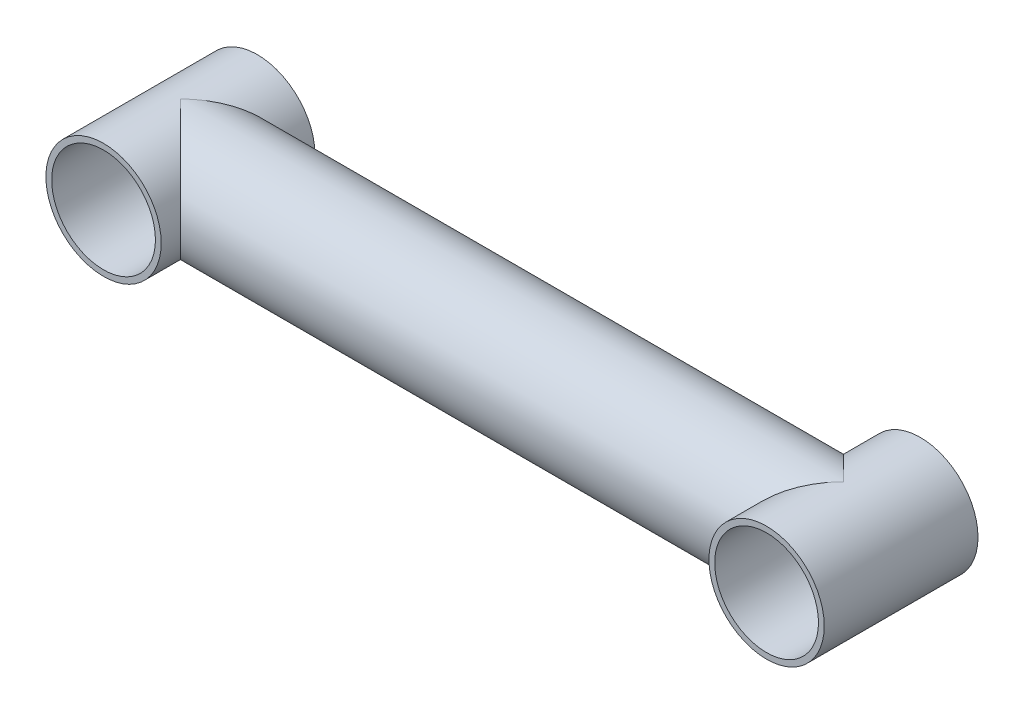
ISO-10303-21;
HEADER;
FILE_DESCRIPTION(('STEP AP214'),'2;1');
FILE_NAME('part.step','',(''),(''),'','','');
FILE_SCHEMA(('AUTOMOTIVE_DESIGN { 1 0 10303 214 1 1 1 1 }'));
ENDSEC;
DATA;
#1=APPLICATION_CONTEXT('core data for automotive mechanical design processes');
#2=APPLICATION_PROTOCOL_DEFINITION('international standard','automotive_design',2000,#1);
#3=PRODUCT_CONTEXT('',#1,'mechanical');
#4=PRODUCT('Part','Part','',(#3));
#5=PRODUCT_RELATED_PRODUCT_CATEGORY('part','',(#4));
#6=PRODUCT_DEFINITION_FORMATION('','',#4);
#7=PRODUCT_DEFINITION_CONTEXT('part definition',#1,'design');
#8=PRODUCT_DEFINITION('design','',#6,#7);
#9=PRODUCT_DEFINITION_SHAPE('','',#8);
#10=(LENGTH_UNIT() NAMED_UNIT(*) SI_UNIT(.MILLI.,.METRE.));
#11=(NAMED_UNIT(*) PLANE_ANGLE_UNIT() SI_UNIT($,.RADIAN.));
#12=(NAMED_UNIT(*) SI_UNIT($,.STERADIAN.) SOLID_ANGLE_UNIT());
#13=UNCERTAINTY_MEASURE_WITH_UNIT(LENGTH_MEASURE(1.E-05),#10,'distance_accuracy_value','');
#14=(GEOMETRIC_REPRESENTATION_CONTEXT(3) GLOBAL_UNCERTAINTY_ASSIGNED_CONTEXT((#13)) GLOBAL_UNIT_ASSIGNED_CONTEXT((#10,
#11,#12)) REPRESENTATION_CONTEXT('',''));
#15=CARTESIAN_POINT('',(0.,0.,0.));
#16=DIRECTION('',(0.,0.,1.));
#17=DIRECTION('',(1.,0.,0.));
#18=AXIS2_PLACEMENT_3D('',#15,#16,#17);
#19=CARTESIAN_POINT('',(-345.,1.38777878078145E-13,0.));
#20=DIRECTION('',(1.,0.,0.));
#21=DIRECTION('',(0.,0.,-1.));
#22=AXIS2_PLACEMENT_3D('',#19,#20,#21);
#23=CYLINDRICAL_SURFACE('',#22,30.);
#24=CARTESIAN_POINT('',(0.,0.,0.));
#25=DIRECTION('',(0.707106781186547,0.,0.707106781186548));
#26=DIRECTION('',(0.707106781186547,0.,-0.707106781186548));
#27=AXIS2_PLACEMENT_3D('',#24,#25,#26);
#28=ELLIPSE('',#27,42.4264068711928,30.);
#29=CARTESIAN_POINT('',(0.,-30.,0.));
#30=VERTEX_POINT('',#29);
#31=CARTESIAN_POINT('',(0.,30.0000000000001,0.));
#32=VERTEX_POINT('',#31);
#33=EDGE_CURVE('E88',#30,#32,#28,.F.);
#34=ORIENTED_EDGE('',*,*,#33,.T.);
#35=CARTESIAN_POINT('',(0.,0.,0.));
#36=DIRECTION('',(0.707106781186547,0.,-0.707106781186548));
#37=DIRECTION('',(0.707106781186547,0.,0.707106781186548));
#38=AXIS2_PLACEMENT_3D('',#35,#36,#37);
#39=ELLIPSE('',#38,42.4264068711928,30.);
#40=EDGE_CURVE('E70',#32,#30,#39,.F.);
#41=ORIENTED_EDGE('',*,*,#40,.T.);
#42=EDGE_LOOP('',(#34,#41));
#43=FACE_BOUND('',#42,.T.);
#44=CARTESIAN_POINT('',(-345.,1.38777878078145E-13,0.));
#45=DIRECTION('',(0.707106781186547,0.,0.707106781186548));
#46=DIRECTION('',(0.707106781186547,0.,-0.707106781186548));
#47=AXIS2_PLACEMENT_3D('',#44,#45,#46);
#48=ELLIPSE('',#47,42.4264068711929,30.);
#49=CARTESIAN_POINT('',(-345.,-29.9999999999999,0.));
#50=VERTEX_POINT('',#49);
#51=CARTESIAN_POINT('',(-345.,30.0000000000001,0.));
#52=VERTEX_POINT('',#51);
#53=EDGE_CURVE('E75',#50,#52,#48,.T.);
#54=ORIENTED_EDGE('',*,*,#53,.T.);
#55=CARTESIAN_POINT('',(-345.,1.38777878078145E-13,0.));
#56=DIRECTION('',(0.707106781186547,0.,-0.707106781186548));
#57=DIRECTION('',(0.707106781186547,0.,0.707106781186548));
#58=AXIS2_PLACEMENT_3D('',#55,#56,#57);
#59=ELLIPSE('',#58,42.4264068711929,30.);
#60=EDGE_CURVE('E63',#52,#50,#59,.T.);
#61=ORIENTED_EDGE('',*,*,#60,.T.);
#62=EDGE_LOOP('',(#54,#61));
#63=FACE_BOUND('',#62,.T.);
#64=ADVANCED_FACE('F45',(#43,#63),#23,.T.);
#65=CARTESIAN_POINT('',(0.,0.,40.));
#66=DIRECTION('',(0.,0.,-1.));
#67=DIRECTION('',(-1.,0.,0.));
#68=AXIS2_PLACEMENT_3D('',#65,#66,#67);
#69=CYLINDRICAL_SURFACE('',#68,30.);
#70=ORIENTED_EDGE('',*,*,#40,.F.);
#71=ORIENTED_EDGE('',*,*,#33,.F.);
#72=EDGE_LOOP('',(#70,#71));
#73=FACE_BOUND('',#72,.T.);
#74=CARTESIAN_POINT('',(0.,0.,40.));
#75=DIRECTION('',(0.,0.,1.));
#76=DIRECTION('',(1.,0.,0.));
#77=AXIS2_PLACEMENT_3D('',#74,#75,#76);
#78=CIRCLE('',#77,30.);
#79=CARTESIAN_POINT('',(30.,0.,40.));
#80=VERTEX_POINT('',#79);
#81=EDGE_CURVE('E84',#80,#80,#78,.T.);
#82=ORIENTED_EDGE('',*,*,#81,.F.);
#83=EDGE_LOOP('',(#82));
#84=FACE_BOUND('',#83,.T.);
#85=CARTESIAN_POINT('',(0.,0.,-40.));
#86=DIRECTION('',(0.,0.,1.));
#87=DIRECTION('',(1.,0.,0.));
#88=AXIS2_PLACEMENT_3D('',#85,#86,#87);
#89=CIRCLE('',#88,30.);
#90=CARTESIAN_POINT('',(30.,0.,-40.));
#91=VERTEX_POINT('',#90);
#92=EDGE_CURVE('E81',#91,#91,#89,.T.);
#93=ORIENTED_EDGE('',*,*,#92,.T.);
#94=EDGE_LOOP('',(#93));
#95=FACE_BOUND('',#94,.T.);
#96=ADVANCED_FACE('F109',(#73,#84,#95),#69,.T.);
#97=CARTESIAN_POINT('',(0.,0.,40.));
#98=DIRECTION('',(0.,0.,1.));
#99=DIRECTION('',(1.,0.,0.));
#100=AXIS2_PLACEMENT_3D('',#97,#98,#99);
#101=PLANE('',#100);
#102=CARTESIAN_POINT('',(0.,0.,40.));
#103=DIRECTION('',(0.,0.,1.));
#104=DIRECTION('',(1.,0.,0.));
#105=AXIS2_PLACEMENT_3D('',#102,#103,#104);
#106=CIRCLE('',#105,27.0000000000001);
#107=CARTESIAN_POINT('',(27.,0.,40.));
#108=VERTEX_POINT('',#107);
#109=EDGE_CURVE('E159',#108,#108,#106,.T.);
#110=ORIENTED_EDGE('',*,*,#109,.F.);
#111=EDGE_LOOP('',(#110));
#112=FACE_BOUND('',#111,.T.);
#113=ORIENTED_EDGE('',*,*,#81,.T.);
#114=EDGE_LOOP('',(#113));
#115=FACE_BOUND('',#114,.T.);
#116=ADVANCED_FACE('F123',(#112,#115),#101,.T.);
#117=CARTESIAN_POINT('',(0.,0.,-40.));
#118=DIRECTION('',(0.,0.,1.));
#119=DIRECTION('',(1.,0.,0.));
#120=AXIS2_PLACEMENT_3D('',#117,#118,#119);
#121=PLANE('',#120);
#122=CARTESIAN_POINT('',(0.,0.,-40.));
#123=DIRECTION('',(0.,0.,1.));
#124=DIRECTION('',(1.,0.,0.));
#125=AXIS2_PLACEMENT_3D('',#122,#123,#124);
#126=CIRCLE('',#125,27.0000000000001);
#127=CARTESIAN_POINT('',(27.,0.,-40.));
#128=VERTEX_POINT('',#127);
#129=EDGE_CURVE('E156',#128,#128,#126,.T.);
#130=ORIENTED_EDGE('',*,*,#129,.T.);
#131=EDGE_LOOP('',(#130));
#132=FACE_BOUND('',#131,.T.);
#133=ORIENTED_EDGE('',*,*,#92,.F.);
#134=EDGE_LOOP('',(#133));
#135=FACE_BOUND('',#134,.T.);
#136=ADVANCED_FACE('F115',(#132,#135),#121,.F.);
#137=CARTESIAN_POINT('',(-345.,1.38777878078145E-13,40.));
#138=DIRECTION('',(0.,0.,-1.));
#139=DIRECTION('',(-1.,0.,0.));
#140=AXIS2_PLACEMENT_3D('',#137,#138,#139);
#141=CYLINDRICAL_SURFACE('',#140,30.);
#142=ORIENTED_EDGE('',*,*,#60,.F.);
#143=ORIENTED_EDGE('',*,*,#53,.F.);
#144=EDGE_LOOP('',(#142,#143));
#145=FACE_BOUND('',#144,.T.);
#146=CARTESIAN_POINT('',(-345.,1.38777878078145E-13,40.));
#147=DIRECTION('',(0.,0.,1.));
#148=DIRECTION('',(1.,0.,0.));
#149=AXIS2_PLACEMENT_3D('',#146,#147,#148);
#150=CIRCLE('',#149,30.);
#151=CARTESIAN_POINT('',(-315.,1.39194211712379E-13,40.));
#152=VERTEX_POINT('',#151);
#153=EDGE_CURVE('E79',#152,#152,#150,.T.);
#154=ORIENTED_EDGE('',*,*,#153,.F.);
#155=EDGE_LOOP('',(#154));
#156=FACE_BOUND('',#155,.T.);
#157=CARTESIAN_POINT('',(-345.,1.38777878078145E-13,-40.));
#158=DIRECTION('',(0.,0.,1.));
#159=DIRECTION('',(1.,0.,0.));
#160=AXIS2_PLACEMENT_3D('',#157,#158,#159);
#161=CIRCLE('',#160,30.);
#162=CARTESIAN_POINT('',(-315.,1.39194211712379E-13,-40.));
#163=VERTEX_POINT('',#162);
#164=EDGE_CURVE('E147',#163,#163,#161,.T.);
#165=ORIENTED_EDGE('',*,*,#164,.T.);
#166=EDGE_LOOP('',(#165));
#167=FACE_BOUND('',#166,.T.);
#168=ADVANCED_FACE('F76',(#145,#156,#167),#141,.T.);
#169=CARTESIAN_POINT('',(-345.,1.38777878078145E-13,40.));
#170=DIRECTION('',(0.,0.,1.));
#171=DIRECTION('',(1.,0.,0.));
#172=AXIS2_PLACEMENT_3D('',#169,#170,#171);
#173=PLANE('',#172);
#174=CARTESIAN_POINT('',(-345.,1.38777878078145E-13,40.));
#175=DIRECTION('',(0.,0.,1.));
#176=DIRECTION('',(1.,0.,0.));
#177=AXIS2_PLACEMENT_3D('',#174,#175,#176);
#178=CIRCLE('',#177,27.);
#179=CARTESIAN_POINT('',(-318.,1.39152578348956E-13,40.));
#180=VERTEX_POINT('',#179);
#181=EDGE_CURVE('E153',#180,#180,#178,.T.);
#182=ORIENTED_EDGE('',*,*,#181,.F.);
#183=EDGE_LOOP('',(#182));
#184=FACE_BOUND('',#183,.T.);
#185=ORIENTED_EDGE('',*,*,#153,.T.);
#186=EDGE_LOOP('',(#185));
#187=FACE_BOUND('',#186,.T.);
#188=ADVANCED_FACE('F114',(#184,#187),#173,.T.);
#189=CARTESIAN_POINT('',(-345.,1.38777878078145E-13,-40.));
#190=DIRECTION('',(0.,0.,1.));
#191=DIRECTION('',(1.,0.,0.));
#192=AXIS2_PLACEMENT_3D('',#189,#190,#191);
#193=PLANE('',#192);
#194=CARTESIAN_POINT('',(-345.,1.38777878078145E-13,-40.));
#195=DIRECTION('',(0.,0.,1.));
#196=DIRECTION('',(1.,0.,0.));
#197=AXIS2_PLACEMENT_3D('',#194,#195,#196);
#198=CIRCLE('',#197,27.);
#199=CARTESIAN_POINT('',(-318.,1.39152578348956E-13,-40.));
#200=VERTEX_POINT('',#199);
#201=EDGE_CURVE('E150',#200,#200,#198,.T.);
#202=ORIENTED_EDGE('',*,*,#201,.T.);
#203=EDGE_LOOP('',(#202));
#204=FACE_BOUND('',#203,.T.);
#205=ORIENTED_EDGE('',*,*,#164,.F.);
#206=EDGE_LOOP('',(#205));
#207=FACE_BOUND('',#206,.T.);
#208=ADVANCED_FACE('F120',(#204,#207),#193,.F.);
#209=CARTESIAN_POINT('',(-345.,1.38777878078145E-13,-40.));
#210=DIRECTION('',(0.,0.,1.));
#211=DIRECTION('',(1.,0.,0.));
#212=AXIS2_PLACEMENT_3D('',#209,#210,#211);
#213=CYLINDRICAL_SURFACE('',#212,27.);
#214=ORIENTED_EDGE('',*,*,#201,.F.);
#215=EDGE_LOOP('',(#214));
#216=FACE_BOUND('',#215,.T.);
#217=ORIENTED_EDGE('',*,*,#181,.T.);
#218=EDGE_LOOP('',(#217));
#219=FACE_BOUND('',#218,.T.);
#220=ADVANCED_FACE('F167',(#216,#219),#213,.F.);
#221=CARTESIAN_POINT('',(0.,0.,-40.));
#222=DIRECTION('',(0.,0.,1.));
#223=DIRECTION('',(1.,0.,0.));
#224=AXIS2_PLACEMENT_3D('',#221,#222,#223);
#225=CYLINDRICAL_SURFACE('',#224,27.0000000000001);
#226=ORIENTED_EDGE('',*,*,#129,.F.);
#227=EDGE_LOOP('',(#226));
#228=FACE_BOUND('',#227,.T.);
#229=ORIENTED_EDGE('',*,*,#109,.T.);
#230=EDGE_LOOP('',(#229));
#231=FACE_BOUND('',#230,.T.);
#232=ADVANCED_FACE('F165',(#228,#231),#225,.F.);
#233=CLOSED_SHELL('',(#64,#96,#116,#136,#168,#188,#208,#220,#232));
#234=CARTESIAN_POINT('',(-315.,0.,-27.));
#235=CARTESIAN_POINT('',(-315.000005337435,0.625774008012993,-26.9999945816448));
#236=CARTESIAN_POINT('',(-315.019622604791,1.25163798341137,-26.9782022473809));
#237=CARTESIAN_POINT('',(-315.097655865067,2.4979836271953,-26.8914583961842));
#238=CARTESIAN_POINT('',(-315.15607939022,3.11846422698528,-26.8264985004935));
#239=CARTESIAN_POINT('',(-315.310469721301,4.34934840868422,-26.6546362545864));
#240=CARTESIAN_POINT('',(-315.406467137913,4.95974335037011,-26.5476997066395));
#241=CARTESIAN_POINT('',(-315.633950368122,6.16534685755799,-26.2938783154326));
#242=CARTESIAN_POINT('',(-315.765435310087,6.76055579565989,-26.1469944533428));
#243=CARTESIAN_POINT('',(-316.060337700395,7.92819257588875,-25.8168457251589));
#244=CARTESIAN_POINT('',(-316.223542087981,8.50074332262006,-25.6338234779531));
#245=CARTESIAN_POINT('',(-316.579542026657,9.62417911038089,-25.233525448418));
#246=CARTESIAN_POINT('',(-316.772337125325,10.1750644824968,-25.0162501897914));
#247=CARTESIAN_POINT('',(-317.184504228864,11.2530565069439,-24.5502266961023));
#248=CARTESIAN_POINT('',(-317.403879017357,11.7801606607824,-24.3014751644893));
#249=CARTESIAN_POINT('',(-317.86619841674,12.8091780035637,-23.775176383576));
#250=CARTESIAN_POINT('',(-318.109148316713,13.3110855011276,-23.4976226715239));
#251=CARTESIAN_POINT('',(-318.539174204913,14.1411644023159,-23.0040262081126));
#252=CARTESIAN_POINT('',(-318.721005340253,14.476083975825,-22.7946753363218));
#253=CARTESIAN_POINT('',(-319.093648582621,15.1328615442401,-22.3640485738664));
#254=CARTESIAN_POINT('',(-319.284458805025,15.4547222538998,-22.142775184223));
#255=CARTESIAN_POINT('',(-319.869142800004,16.400907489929,-21.4619255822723));
#256=CARTESIAN_POINT('',(-320.275194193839,17.005690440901,-20.9854065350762));
#257=CARTESIAN_POINT('',(-321.113055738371,18.1638668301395,-19.9914435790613));
#258=CARTESIAN_POINT('',(-321.544918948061,18.7171479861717,-19.4739146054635));
#259=CARTESIAN_POINT('',(-322.426567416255,19.7714988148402,-18.4025169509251));
#260=CARTESIAN_POINT('',(-322.876350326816,20.2725752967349,-17.8486530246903));
#261=CARTESIAN_POINT('',(-323.797349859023,21.2344359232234,-16.6936156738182));
#262=CARTESIAN_POINT('',(-324.268821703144,21.694009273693,-16.0916406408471));
#263=CARTESIAN_POINT('',(-325.215045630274,22.5602898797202,-14.8527773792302));
#264=CARTESIAN_POINT('',(-325.689798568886,22.9669827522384,-14.2158797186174));
#265=CARTESIAN_POINT('',(-326.396230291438,23.5370203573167,-13.2344729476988));
#266=CARTESIAN_POINT('',(-326.630573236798,23.7202356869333,-12.9032685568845));
#267=CARTESIAN_POINT('',(-327.095968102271,24.0734479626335,-12.2316434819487));
#268=CARTESIAN_POINT('',(-327.327020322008,24.2434461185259,-11.8912236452));
#269=CARTESIAN_POINT('',(-327.783941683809,24.5700256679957,-11.2008739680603));
#270=CARTESIAN_POINT('',(-328.009813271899,24.7266134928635,-10.850948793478));
#271=CARTESIAN_POINT('',(-328.454289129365,25.0262112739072,-10.1408693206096));
#272=CARTESIAN_POINT('',(-328.67289440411,25.169223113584,-9.78071645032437));
#273=CARTESIAN_POINT('',(-329.099488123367,25.4408615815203,-9.05062255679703));
#274=CARTESIAN_POINT('',(-329.307509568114,25.5695346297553,-8.68071821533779));
#275=CARTESIAN_POINT('',(-329.710423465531,25.8124809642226,-7.92917261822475));
#276=CARTESIAN_POINT('',(-329.905316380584,25.926754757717,-7.54753177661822));
#277=CARTESIAN_POINT('',(-330.277774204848,26.1400476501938,-6.77196846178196));
#278=CARTESIAN_POINT('',(-330.455349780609,26.2390761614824,-6.37805374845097));
#279=CARTESIAN_POINT('',(-330.788282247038,26.420883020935,-5.57722537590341));
#280=CARTESIAN_POINT('',(-330.943642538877,26.5036638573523,-5.1703137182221));
#281=CARTESIAN_POINT('',(-331.202359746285,26.6391204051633,-4.41350207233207));
#282=CARTESIAN_POINT('',(-331.310068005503,26.6945195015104,-4.06558597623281));
#283=CARTESIAN_POINT('',(-331.502362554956,26.7922645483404,-3.36165658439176));
#284=CARTESIAN_POINT('',(-331.586956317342,26.8346147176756,-3.00564594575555));
#285=CARTESIAN_POINT('',(-331.729351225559,26.90531975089,-2.28769366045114));
#286=CARTESIAN_POINT('',(-331.787211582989,26.9337055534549,-1.92576697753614));
#287=CARTESIAN_POINT('',(-331.873557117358,26.9758937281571,-1.19754941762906));
#288=CARTESIAN_POINT('',(-331.902044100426,26.9896969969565,-0.831258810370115));
#289=CARTESIAN_POINT('',(-331.928154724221,27.0023534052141,-0.095292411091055));
#290=CARTESIAN_POINT('',(-331.925608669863,27.0011243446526,0.274390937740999));
#291=CARTESIAN_POINT('',(-331.889387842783,26.983554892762,1.01184684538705));
#292=CARTESIAN_POINT('',(-331.855712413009,26.9672141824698,1.37961936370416));
#293=CARTESIAN_POINT('',(-331.758985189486,26.9198512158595,2.11096559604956));
#294=CARTESIAN_POINT('',(-331.695878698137,26.8888016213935,2.47453019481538));
#295=CARTESIAN_POINT('',(-331.54335217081,26.8127927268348,3.194575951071));
#296=CARTESIAN_POINT('',(-331.453927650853,26.7678310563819,3.55105589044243));
#297=CARTESIAN_POINT('',(-331.209249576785,26.642845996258,4.40650703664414));
#298=CARTESIAN_POINT('',(-331.042205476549,26.5560534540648,4.90111553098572));
#299=CARTESIAN_POINT('',(-330.672524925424,26.3584391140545,5.87183562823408));
#300=CARTESIAN_POINT('',(-330.46986833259,26.2476037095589,6.34793657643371));
#301=CARTESIAN_POINT('',(-330.037408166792,26.0035136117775,7.28367159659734));
#302=CARTESIAN_POINT('',(-329.80751203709,25.8701817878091,7.74324218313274));
#303=CARTESIAN_POINT('',(-329.328472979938,25.5828315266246,8.64539476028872));
#304=CARTESIAN_POINT('',(-329.079331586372,25.4288147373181,9.08797810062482));
#305=CARTESIAN_POINT('',(-328.586394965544,25.1132000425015,9.92533139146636));
#306=CARTESIAN_POINT('',(-328.343574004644,24.9530119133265,10.3212128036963));
#307=CARTESIAN_POINT('',(-327.849658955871,24.6161569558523,11.1006801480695));
#308=CARTESIAN_POINT('',(-327.598563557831,24.4394875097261,11.4842641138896));
#309=CARTESIAN_POINT('',(-327.090751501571,24.069846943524,12.2400793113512));
#310=CARTESIAN_POINT('',(-326.834031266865,23.8768652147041,12.6123029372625));
#311=CARTESIAN_POINT('',(-326.317415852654,23.4748417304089,13.3456601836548));
#312=CARTESIAN_POINT('',(-326.057520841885,23.2658008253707,13.7067943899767));
#313=CARTESIAN_POINT('',(-325.536458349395,22.8316781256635,14.4183266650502));
#314=CARTESIAN_POINT('',(-325.275290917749,22.6065969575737,14.7687251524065));
#315=CARTESIAN_POINT('',(-324.753322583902,22.1403388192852,15.458939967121));
#316=CARTESIAN_POINT('',(-324.492521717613,21.8991603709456,15.7987553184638));
#317=CARTESIAN_POINT('',(-323.713173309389,21.151566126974,16.8019955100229));
#318=CARTESIAN_POINT('',(-323.197330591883,20.6208039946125,17.449685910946));
#319=CARTESIAN_POINT('',(-322.25641569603,19.5742568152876,18.610980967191));
#320=CARTESIAN_POINT('',(-321.828916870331,19.0671958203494,19.1305106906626));
#321=CARTESIAN_POINT('',(-320.993523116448,18.0040576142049,20.1342593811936));
#322=CARTESIAN_POINT('',(-320.585629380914,17.4479774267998,20.6184762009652));
#323=CARTESIAN_POINT('',(-319.796604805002,16.2874241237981,21.5469442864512));
#324=CARTESIAN_POINT('',(-319.415428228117,15.6830376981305,21.9912642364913));
#325=CARTESIAN_POINT('',(-318.868433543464,14.7401931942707,22.6245445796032));
#326=CARTESIAN_POINT('',(-318.690242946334,14.4198932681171,22.8300904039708));
#327=CARTESIAN_POINT('',(-318.34289934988,13.7671957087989,23.2295233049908));
#328=CARTESIAN_POINT('',(-318.173748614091,13.434795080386,23.4234074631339));
#329=CARTESIAN_POINT('',(-317.756635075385,12.5751623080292,23.9002213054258));
#330=CARTESIAN_POINT('',(-317.515523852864,12.03978472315,24.1745996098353));
#331=CARTESIAN_POINT('',(-317.060523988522,10.942502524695,24.6906689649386));
#332=CARTESIAN_POINT('',(-316.846628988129,10.3806041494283,24.9323676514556));
#333=CARTESIAN_POINT('',(-316.449474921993,9.23235504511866,25.3799750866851));
#334=CARTESIAN_POINT('',(-316.266207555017,8.64601099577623,25.5858935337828));
#335=CARTESIAN_POINT('',(-315.933576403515,7.45166043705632,25.9588925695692));
#336=CARTESIAN_POINT('',(-315.784213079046,6.84365363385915,26.1259726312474));
#337=CARTESIAN_POINT('',(-315.521434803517,5.60516361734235,26.4195026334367));
#338=CARTESIAN_POINT('',(-315.408300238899,4.97454520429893,26.5456357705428));
#339=CARTESIAN_POINT('',(-315.222089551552,3.70009505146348,26.7530566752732));
#340=CARTESIAN_POINT('',(-315.149013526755,3.05626327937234,26.8343443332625));
#341=CARTESIAN_POINT('',(-315.044710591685,1.76134663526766,26.9503248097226));
#342=CARTESIAN_POINT('',(-315.013463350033,1.11026544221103,26.985040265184));
#343=CARTESIAN_POINT('',(-314.993543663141,-0.193318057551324,27.0071740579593));
#344=CARTESIAN_POINT('',(-315.004866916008,-0.845820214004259,26.9945971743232));
#345=CARTESIAN_POINT('',(-315.065949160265,-2.06943823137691,26.92670746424));
#346=CARTESIAN_POINT('',(-315.111025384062,-2.64109041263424,26.8766011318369));
#347=CARTESIAN_POINT('',(-315.233186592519,-3.77661597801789,26.7406819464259));
#348=CARTESIAN_POINT('',(-315.310268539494,-4.34049009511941,26.6548724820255));
#349=CARTESIAN_POINT('',(-315.49503174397,-5.45683227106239,26.4489171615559));
#350=CARTESIAN_POINT('',(-315.602714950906,-6.00929960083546,26.3287691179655));
#351=CARTESIAN_POINT('',(-315.846829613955,-7.09963507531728,26.0559216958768));
#352=CARTESIAN_POINT('',(-315.983262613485,-7.63750243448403,25.9032205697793));
#353=CARTESIAN_POINT('',(-316.286386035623,-8.70895637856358,25.563209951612));
#354=CARTESIAN_POINT('',(-316.453735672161,-9.24211548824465,25.3751444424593));
#355=CARTESIAN_POINT('',(-316.813822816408,-10.2881195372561,24.9693678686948));
#356=CARTESIAN_POINT('',(-317.006559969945,-10.8009647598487,24.7516572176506));
#357=CARTESIAN_POINT('',(-317.414869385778,-11.8048416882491,24.2889128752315));
#358=CARTESIAN_POINT('',(-317.63044611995,-12.2958690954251,24.0438738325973));
#359=CARTESIAN_POINT('',(-318.081878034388,-13.255026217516,23.528720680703));
#360=CARTESIAN_POINT('',(-318.317737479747,-13.7231510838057,23.2586012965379));
#361=CARTESIAN_POINT('',(-318.745851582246,-14.5213739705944,22.7660097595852));
#362=CARTESIAN_POINT('',(-318.934230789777,-14.8566750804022,22.5485499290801));
#363=CARTESIAN_POINT('',(-319.319878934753,-15.5137519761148,22.1016142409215));
#364=CARTESIAN_POINT('',(-319.51714635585,-15.8355300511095,21.872140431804));
#365=CARTESIAN_POINT('',(-320.121029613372,-16.7808218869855,21.1665435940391));
#366=CARTESIAN_POINT('',(-320.539632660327,-17.3841201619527,20.6733526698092));
#367=CARTESIAN_POINT('',(-321.402030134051,-18.5379653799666,19.6454242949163));
#368=CARTESIAN_POINT('',(-321.845887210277,-19.0883711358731,19.1105821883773));
#369=CARTESIAN_POINT('',(-322.750404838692,-20.1353883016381,18.0040604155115));
#370=CARTESIAN_POINT('',(-323.211062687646,-20.6320083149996,17.4323866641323));
#371=CARTESIAN_POINT('',(-324.152341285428,-21.5831656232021,16.24073908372));
#372=CARTESIAN_POINT('',(-324.633177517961,-22.0364736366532,15.6199572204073));
#373=CARTESIAN_POINT('',(-325.595817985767,-22.888655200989,14.3422322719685));
#374=CARTESIAN_POINT('',(-326.077622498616,-23.2875098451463,13.6852767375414));
#375=CARTESIAN_POINT('',(-326.791807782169,-23.8443466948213,12.6726029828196));
#376=CARTESIAN_POINT('',(-327.028209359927,-24.0228882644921,12.3308721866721));
#377=CARTESIAN_POINT('',(-327.496625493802,-24.3662908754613,11.6375933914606));
#378=CARTESIAN_POINT('',(-327.728639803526,-24.5311511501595,11.2860448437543));
#379=CARTESIAN_POINT('',(-328.186002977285,-24.8468644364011,10.5728567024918));
#380=CARTESIAN_POINT('',(-328.411356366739,-24.9977271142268,10.2112243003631));
#381=CARTESIAN_POINT('',(-328.852960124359,-25.2852225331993,9.47696949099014));
#382=CARTESIAN_POINT('',(-329.069212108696,-25.421857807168,9.10434905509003));
#383=CARTESIAN_POINT('',(-329.477686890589,-25.6731774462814,8.36842618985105));
#384=CARTESIAN_POINT('',(-329.670577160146,-25.7886624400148,8.00576983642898));
#385=CARTESIAN_POINT('',(-330.042076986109,-26.0058998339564,7.26915467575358));
#386=CARTESIAN_POINT('',(-330.220687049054,-26.1076527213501,6.89519627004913));
#387=CARTESIAN_POINT('',(-330.559345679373,-26.2964836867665,6.13578556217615));
#388=CARTESIAN_POINT('',(-330.719413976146,-26.3835774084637,5.75034603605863));
#389=CARTESIAN_POINT('',(-331.016292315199,-26.5421224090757,4.96741020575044));
#390=CARTESIAN_POINT('',(-331.153106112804,-26.6135762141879,4.56991586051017));
#391=CARTESIAN_POINT('',(-331.378192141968,-26.7293793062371,3.82850265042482));
#392=CARTESIAN_POINT('',(-331.470734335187,-26.7762412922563,3.48628032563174));
#393=CARTESIAN_POINT('',(-331.632190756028,-26.857212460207,2.79485322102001));
#394=CARTESIAN_POINT('',(-331.701112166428,-26.8913255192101,2.44565059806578));
#395=CARTESIAN_POINT('',(-331.812266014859,-26.9460115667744,1.74256334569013));
#396=CARTESIAN_POINT('',(-331.854546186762,-26.9666087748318,1.38868825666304));
#397=CARTESIAN_POINT('',(-331.910520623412,-26.9938237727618,0.678125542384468));
#398=CARTESIAN_POINT('',(-331.924215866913,-27.0004420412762,0.321438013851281));
#399=CARTESIAN_POINT('',(-331.92229330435,-26.9995108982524,-0.392735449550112));
#400=CARTESIAN_POINT('',(-331.906601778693,-26.9919258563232,-0.750221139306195));
#401=CARTESIAN_POINT('',(-331.846594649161,-26.9627338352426,-1.46217520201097));
#402=CARTESIAN_POINT('',(-331.802278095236,-26.9411263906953,-1.81664347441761));
#403=CARTESIAN_POINT('',(-331.687098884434,-26.8843960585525,-2.52076746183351));
#404=CARTESIAN_POINT('',(-331.616186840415,-26.8492480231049,-2.87041296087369));
#405=CARTESIAN_POINT('',(-331.450883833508,-26.7662098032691,-3.56252432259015));
#406=CARTESIAN_POINT('',(-331.356489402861,-26.7183177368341,-3.90498911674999));
#407=CARTESIAN_POINT('',(-331.090762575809,-26.5813078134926,-4.76591904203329));
#408=CARTESIAN_POINT('',(-330.905510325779,-26.4839359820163,-5.27878306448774));
#409=CARTESIAN_POINT('',(-330.498955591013,-26.2635324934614,-6.28428616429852));
#410=CARTESIAN_POINT('',(-330.27762917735,-26.1404837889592,-6.77691154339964));
#411=CARTESIAN_POINT('',(-329.807982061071,-25.8703741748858,-7.74447464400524));
#412=CARTESIAN_POINT('',(-329.559566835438,-25.7232282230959,-8.21934212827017));
#413=CARTESIAN_POINT('',(-329.044107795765,-25.4067116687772,-9.15101326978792));
#414=CARTESIAN_POINT('',(-328.777066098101,-25.2373435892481,-9.60781897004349));
#415=CARTESIAN_POINT('',(-328.255656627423,-24.8940791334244,-10.4631177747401));
#416=CARTESIAN_POINT('',(-328.002429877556,-24.7220785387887,-10.8630757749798));
#417=CARTESIAN_POINT('',(-327.488736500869,-24.3609165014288,-11.65046676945));
#418=CARTESIAN_POINT('',(-327.228268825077,-24.1717525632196,-12.0378979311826));
#419=CARTESIAN_POINT('',(-326.702673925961,-23.7763767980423,-12.8011215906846));
#420=CARTESIAN_POINT('',(-326.437543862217,-23.570154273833,-13.1769065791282));
#421=CARTESIAN_POINT('',(-325.905031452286,-23.1408547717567,-13.9170343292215));
#422=CARTESIAN_POINT('',(-325.637649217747,-22.9177786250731,-14.2813776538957));
#423=CARTESIAN_POINT('',(-325.102644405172,-22.4548502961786,-14.9987272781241));
#424=CARTESIAN_POINT('',(-324.835022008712,-22.2150063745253,-15.3517390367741));
#425=CARTESIAN_POINT('',(-324.301069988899,-21.7183638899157,-16.0466522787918));
#426=CARTESIAN_POINT('',(-324.034740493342,-21.4615636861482,-16.3885526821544));
#427=CARTESIAN_POINT('',(-323.240259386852,-20.6657932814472,-17.397082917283));
#428=CARTESIAN_POINT('',(-322.716230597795,-20.1011247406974,-18.0470516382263));
#429=CARTESIAN_POINT('',(-321.78751612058,-19.0155327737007,-19.1808136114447));
#430=CARTESIAN_POINT('',(-321.378963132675,-18.5064466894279,-19.6728270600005));
#431=CARTESIAN_POINT('',(-320.582402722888,-17.4419834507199,-20.6224626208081));
#432=CARTESIAN_POINT('',(-320.194395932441,-16.8866048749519,-21.0800836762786));
#433=CARTESIAN_POINT('',(-319.445466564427,-15.7302090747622,-21.9564525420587));
#434=CARTESIAN_POINT('',(-319.084504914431,-15.1292603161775,-22.3752566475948));
#435=CARTESIAN_POINT('',(-318.567820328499,-14.193899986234,-22.9710655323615));
#436=CARTESIAN_POINT('',(-318.399729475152,-13.8764806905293,-23.1642564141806));
#437=CARTESIAN_POINT('',(-318.0725250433,-13.2303535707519,-23.5392716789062));
#438=CARTESIAN_POINT('',(-317.91341372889,-12.9016429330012,-23.7210931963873));
#439=CARTESIAN_POINT('',(-317.51734171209,-12.0431218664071,-24.1725887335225));
#440=CARTESIAN_POINT('',(-317.287570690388,-11.5052623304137,-24.433416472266));
#441=CARTESIAN_POINT('',(-316.855692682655,-10.4042098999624,-24.9221812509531));
#442=CARTESIAN_POINT('',(-316.65357968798,-9.84102254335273,-25.1501254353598));
#443=CARTESIAN_POINT('',(-316.280456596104,-8.69207718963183,-25.5699318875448));
#444=CARTESIAN_POINT('',(-316.109412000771,-8.10634511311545,-25.7618341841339));
#445=CARTESIAN_POINT('',(-315.801321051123,-6.91487539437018,-26.1068744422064));
#446=CARTESIAN_POINT('',(-315.664267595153,-6.30914196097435,-26.2600205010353));
#447=CARTESIAN_POINT('',(-315.456254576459,-5.23342441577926,-26.4921655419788));
#448=CARTESIAN_POINT('',(-315.377331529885,-4.7668868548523,-26.5801353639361));
#449=CARTESIAN_POINT('',(-315.241258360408,-3.82660680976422,-26.7317007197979));
#450=CARTESIAN_POINT('',(-315.184111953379,-3.35286311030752,-26.7952920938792));
#451=CARTESIAN_POINT('',(-315.092363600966,-2.400451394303,-26.8973458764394));
#452=CARTESIAN_POINT('',(-315.057763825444,-1.92178290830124,-26.935805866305));
#453=CARTESIAN_POINT('',(-315.011582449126,-0.962093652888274,-26.9871322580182));
#454=CARTESIAN_POINT('',(-314.999995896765,-0.481073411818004,-27.0000041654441));
#455=CARTESIAN_POINT('',(-315.,0.,-27.));
#456=B_SPLINE_CURVE_WITH_KNOTS('',3,(#234,#235,#236,#237,#238,#239,#240,#241,#242,#243,#244,
#245,#246,#247,#248,#249,#250,#251,#252,#253,#254,#255,#256,#257,#258,#259,#260,#261,#262,#263,
#264,#265,#266,#267,#268,#269,#270,#271,#272,#273,#274,#275,#276,#277,#278,#279,#280,#281,#282,
#283,#284,#285,#286,#287,#288,#289,#290,#291,#292,#293,#294,#295,#296,#297,#298,#299,#300,#301,
#302,#303,#304,#305,#306,#307,#308,#309,#310,#311,#312,#313,#314,#315,#316,#317,#318,#319,#320,
#321,#322,#323,#324,#325,#326,#327,#328,#329,#330,#331,#332,#333,#334,#335,#336,#337,#338,#339,
#340,#341,#342,#343,#344,#345,#346,#347,#348,#349,#350,#351,#352,#353,#354,#355,#356,#357,#358,
#359,#360,#361,#362,#363,#364,#365,#366,#367,#368,#369,#370,#371,#372,#373,#374,#375,#376,#377,
#378,#379,#380,#381,#382,#383,#384,#385,#386,#387,#388,#389,#390,#391,#392,#393,#394,#395,#396,
#397,#398,#399,#400,#401,#402,#403,#404,#405,#406,#407,#408,#409,#410,#411,#412,#413,#414,#415,
#416,#417,#418,#419,#420,#421,#422,#423,#424,#425,#426,#427,#428,#429,#430,#431,#432,#433,#434,
#435,#436,#437,#438,#439,#440,#441,#442,#443,#444,#445,#446,#447,#448,#449,#450,#451,#452,#453,
#454,#455),.UNSPECIFIED.,.T.,.F.,(4,2,2,2,2,2,2,2,2,2,2,2,2,2,2,2,2,2,2,2,2,2,2,2,2,2,2,2,2,2,2,
2,2,2,2,2,2,2,2,2,2,2,2,2,2,2,2,2,2,2,2,2,2,2,2,2,2,2,2,2,2,2,2,2,2,2,2,2,2,2,2,2,2,2,2,2,2,2,2,
2,2,2,2,2,2,2,2,2,2,2,2,2,2,2,2,2,2,2,2,2,2,2,2,2,2,2,2,2,2,2,4),(0.,1.87679870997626,
3.75396181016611,5.63265739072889,7.51130683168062,9.37774816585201,11.2441609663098,
13.11076940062,14.9777975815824,16.2817901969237,17.5855103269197,20.1935031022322,
22.8070547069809,25.4202649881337,28.0943611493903,30.7691831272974,32.1044653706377,
33.439625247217,34.7741411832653,36.1084717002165,37.438348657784,38.7681787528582,
40.0971845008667,41.4259865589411,42.5302695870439,43.6341952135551,44.7356639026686,
45.8370648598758,46.9444911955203,48.0519409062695,49.1614570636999,50.271162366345,
51.856145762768,53.4420285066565,55.0334633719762,56.6247715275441,58.0980414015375,
59.5715456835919,61.046015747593,62.5204077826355,63.9947422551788,65.4692122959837,
68.4161974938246,70.9415006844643,73.466957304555,75.9879793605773,77.2482988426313,
78.5089324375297,80.4513473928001,82.3933077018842,84.3347408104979,86.2762002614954,
88.2323412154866,90.1884869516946,92.1436815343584,94.0986785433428,95.8234764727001,
97.548110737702,99.2728548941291,100.997691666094,102.764772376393,104.531828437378,
106.29923112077,108.06700637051,109.391996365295,110.71676116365,113.366961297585,
116.024049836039,118.680712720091,121.398424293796,124.117077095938,125.473602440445,
126.830203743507,128.185861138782,129.541276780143,130.820816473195,132.100310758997,
133.37843084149,134.65634432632,135.728192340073,136.799714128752,137.869310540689,
138.938870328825,140.011116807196,141.083398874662,142.157682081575,143.232124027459,
144.891049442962,146.551079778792,148.21710007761,149.882931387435,151.393388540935,
152.904065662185,154.415697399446,155.92725463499,157.438072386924,158.949036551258,
161.968816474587,164.419022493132,166.869303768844,169.315973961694,170.5391358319,
171.762604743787,173.681894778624,175.600767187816,177.51749569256,179.43382340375,
180.876566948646,182.319556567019,183.762685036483,185.205502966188),.UNSPECIFIED.);
#457=CARTESIAN_POINT('',(-315.,0.,-27.));
#458=VERTEX_POINT('',#457);
#459=EDGE_CURVE('E13',#458,#458,#456,.T.);
#460=ORIENTED_EDGE('',*,*,#459,.T.);
#461=EDGE_LOOP('',(#460));
#462=FACE_BOUND('',#461,.T.);
#463=ADVANCED_FACE('F102',(#462),#141,.T.);
#464=CARTESIAN_POINT('',(-29.9999999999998,1.38777878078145E-13,-27.));
#465=CARTESIAN_POINT('',(-29.9999946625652,-0.625774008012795,-26.9999945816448));
#466=CARTESIAN_POINT('',(-29.9803773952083,-1.25163798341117,-26.9782022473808));
#467=CARTESIAN_POINT('',(-29.9023441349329,-2.49798362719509,-26.8914583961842));
#468=CARTESIAN_POINT('',(-29.8439206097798,-3.11846422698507,-26.8264985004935));
#469=CARTESIAN_POINT('',(-29.6895302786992,-4.349348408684,-26.6546362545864));
#470=CARTESIAN_POINT('',(-29.5935328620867,-4.95974335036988,-26.5476997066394));
#471=CARTESIAN_POINT('',(-29.3660496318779,-6.16534685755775,-26.2938783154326));
#472=CARTESIAN_POINT('',(-29.2345646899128,-6.76055579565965,-26.1469944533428));
#473=CARTESIAN_POINT('',(-28.9396622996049,-7.9281925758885,-25.8168457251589));
#474=CARTESIAN_POINT('',(-28.7764579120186,-8.5007433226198,-25.6338234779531));
#475=CARTESIAN_POINT('',(-28.4204579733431,-9.62417911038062,-25.233525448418));
#476=CARTESIAN_POINT('',(-28.2276628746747,-10.1750644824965,-25.0162501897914));
#477=CARTESIAN_POINT('',(-27.8154957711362,-11.2530565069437,-24.5502266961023));
#478=CARTESIAN_POINT('',(-27.5961209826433,-11.7801606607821,-24.3014751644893));
#479=CARTESIAN_POINT('',(-27.1338015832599,-12.8091780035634,-23.7751763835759));
#480=CARTESIAN_POINT('',(-26.8908516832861,-13.3110855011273,-23.497622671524));
#481=CARTESIAN_POINT('',(-26.4608257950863,-14.1411644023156,-23.0040262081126));
#482=CARTESIAN_POINT('',(-26.2789946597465,-14.4760839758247,-22.7946753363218));
#483=CARTESIAN_POINT('',(-25.9063514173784,-15.1328615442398,-22.3640485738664));
#484=CARTESIAN_POINT('',(-25.7155411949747,-15.4547222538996,-22.142775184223));
#485=CARTESIAN_POINT('',(-25.1308571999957,-16.4009074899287,-21.4619255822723));
#486=CARTESIAN_POINT('',(-24.7248058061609,-17.0056904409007,-20.9854065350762));
#487=CARTESIAN_POINT('',(-23.8869442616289,-18.1638668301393,-19.9914435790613));
#488=CARTESIAN_POINT('',(-23.455081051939,-18.7171479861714,-19.4739146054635));
#489=CARTESIAN_POINT('',(-22.5734325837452,-19.7714988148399,-18.4025169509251));
#490=CARTESIAN_POINT('',(-22.1236496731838,-20.2725752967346,-17.8486530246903));
#491=CARTESIAN_POINT('',(-21.2026501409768,-21.2344359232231,-16.6936156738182));
#492=CARTESIAN_POINT('',(-20.7311782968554,-21.6940092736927,-16.0916406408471));
#493=CARTESIAN_POINT('',(-19.7849543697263,-22.5602898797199,-14.8527773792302));
#494=CARTESIAN_POINT('',(-19.3102014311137,-22.9669827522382,-14.2158797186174));
#495=CARTESIAN_POINT('',(-18.6037697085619,-23.5370203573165,-13.2344729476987));
#496=CARTESIAN_POINT('',(-18.3694267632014,-23.7202356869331,-12.9032685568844));
#497=CARTESIAN_POINT('',(-17.9040318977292,-24.0734479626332,-12.2316434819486));
#498=CARTESIAN_POINT('',(-17.6729796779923,-24.2434461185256,-11.8912236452));
#499=CARTESIAN_POINT('',(-17.2160583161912,-24.5700256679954,-11.2008739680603));
#500=CARTESIAN_POINT('',(-16.9901867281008,-24.7266134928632,-10.8509487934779));
#501=CARTESIAN_POINT('',(-16.5457108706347,-25.0262112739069,-10.1408693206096));
#502=CARTESIAN_POINT('',(-16.3271055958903,-25.1692231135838,-9.78071645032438));
#503=CARTESIAN_POINT('',(-15.900511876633,-25.4408615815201,-9.05062255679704));
#504=CARTESIAN_POINT('',(-15.6924904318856,-25.569534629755,-8.68071821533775));
#505=CARTESIAN_POINT('',(-15.2895765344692,-25.8124809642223,-7.92917261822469));
#506=CARTESIAN_POINT('',(-15.0946836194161,-25.9267547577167,-7.54753177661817));
#507=CARTESIAN_POINT('',(-14.7222257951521,-26.1400476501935,-6.77196846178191));
#508=CARTESIAN_POINT('',(-14.5446502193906,-26.2390761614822,-6.3780537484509));
#509=CARTESIAN_POINT('',(-14.2117177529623,-26.4208830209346,-5.57722537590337));
#510=CARTESIAN_POINT('',(-14.0563574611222,-26.5036638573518,-5.17031371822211));
#511=CARTESIAN_POINT('',(-13.797640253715,-26.6391204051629,-4.41350207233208));
#512=CARTESIAN_POINT('',(-13.6899319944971,-26.69451950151,-4.06558597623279));
#513=CARTESIAN_POINT('',(-13.497637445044,-26.7922645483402,-3.36165658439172));
#514=CARTESIAN_POINT('',(-13.4130436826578,-26.8346147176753,-3.00564594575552));
#515=CARTESIAN_POINT('',(-13.2706487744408,-26.9053197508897,-2.28769366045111));
#516=CARTESIAN_POINT('',(-13.2127884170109,-26.9337055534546,-1.92576697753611));
#517=CARTESIAN_POINT('',(-13.1264428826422,-26.9758937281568,-1.19754941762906));
#518=CARTESIAN_POINT('',(-13.0979558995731,-26.9896969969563,-0.831258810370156));
#519=CARTESIAN_POINT('',(-13.071845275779,-27.0023534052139,-0.0952924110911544));
#520=CARTESIAN_POINT('',(-13.0743913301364,-27.0011243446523,0.274390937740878));
#521=CARTESIAN_POINT('',(-13.1106121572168,-26.9835548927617,1.01184684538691));
#522=CARTESIAN_POINT('',(-13.1442875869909,-26.9672141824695,1.37961936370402));
#523=CARTESIAN_POINT('',(-13.241014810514,-26.9198512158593,2.1109655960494));
#524=CARTESIAN_POINT('',(-13.3041213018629,-26.8888016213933,2.47453019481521));
#525=CARTESIAN_POINT('',(-13.45664782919,-26.8127927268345,3.19457595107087));
#526=CARTESIAN_POINT('',(-13.5460723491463,-26.7678310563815,3.55105589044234));
#527=CARTESIAN_POINT('',(-13.7907504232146,-26.6428459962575,4.40650703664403));
#528=CARTESIAN_POINT('',(-13.9577945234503,-26.5560534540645,4.90111553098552));
#529=CARTESIAN_POINT('',(-14.3274750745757,-26.3584391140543,5.8718356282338));
#530=CARTESIAN_POINT('',(-14.5301316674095,-26.2476037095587,6.34793657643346));
#531=CARTESIAN_POINT('',(-14.9625918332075,-26.0035136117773,7.28367159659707));
#532=CARTESIAN_POINT('',(-15.1924879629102,-25.8701817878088,7.74324218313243));
#533=CARTESIAN_POINT('',(-15.671527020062,-25.5828315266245,8.64539476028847));
#534=CARTESIAN_POINT('',(-15.9206684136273,-25.4288147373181,9.08797810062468));
#535=CARTESIAN_POINT('',(-16.413605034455,-25.1132000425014,9.92533139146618));
#536=CARTESIAN_POINT('',(-16.656425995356,-24.9530119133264,10.321212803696));
#537=CARTESIAN_POINT('',(-17.1503410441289,-24.6161569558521,11.1006801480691));
#538=CARTESIAN_POINT('',(-17.4014364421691,-24.439487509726,11.4842641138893));
#539=CARTESIAN_POINT('',(-17.9092484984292,-24.0698469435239,12.2400793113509));
#540=CARTESIAN_POINT('',(-18.1659687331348,-23.876865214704,12.6123029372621));
#541=CARTESIAN_POINT('',(-18.682584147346,-23.4748417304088,13.3456601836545));
#542=CARTESIAN_POINT('',(-18.9424791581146,-23.2658008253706,13.7067943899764));
#543=CARTESIAN_POINT('',(-19.4635416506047,-22.8316781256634,14.4183266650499));
#544=CARTESIAN_POINT('',(-19.7247090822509,-22.6065969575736,14.7687251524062));
#545=CARTESIAN_POINT('',(-20.2466774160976,-22.1403388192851,15.4589399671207));
#546=CARTESIAN_POINT('',(-20.5074782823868,-21.8991603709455,15.7987553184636));
#547=CARTESIAN_POINT('',(-21.2868266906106,-21.1515661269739,16.8019955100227));
#548=CARTESIAN_POINT('',(-21.8026694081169,-20.6208039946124,17.4496859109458));
#549=CARTESIAN_POINT('',(-22.7435843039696,-19.5742568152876,18.6109809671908));
#550=CARTESIAN_POINT('',(-23.171083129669,-19.0671958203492,19.1305106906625));
#551=CARTESIAN_POINT('',(-24.0064768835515,-18.0040576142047,20.1342593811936));
#552=CARTESIAN_POINT('',(-24.4143706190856,-17.4479774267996,20.6184762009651));
#553=CARTESIAN_POINT('',(-25.2033951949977,-16.2874241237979,21.5469442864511));
#554=CARTESIAN_POINT('',(-25.584571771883,-15.6830376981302,21.9912642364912));
#555=CARTESIAN_POINT('',(-26.1315664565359,-14.7401931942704,22.6245445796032));
#556=CARTESIAN_POINT('',(-26.3097570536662,-14.4198932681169,22.8300904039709));
#557=CARTESIAN_POINT('',(-26.6571006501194,-13.7671957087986,23.2295233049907));
#558=CARTESIAN_POINT('',(-26.8262513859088,-13.4347950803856,23.4234074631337));
#559=CARTESIAN_POINT('',(-27.2433649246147,-12.5751623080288,23.9002213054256));
#560=CARTESIAN_POINT('',(-27.4844761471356,-12.0397847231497,24.1745996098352));
#561=CARTESIAN_POINT('',(-27.9394760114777,-10.9425025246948,24.6906689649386));
#562=CARTESIAN_POINT('',(-28.1533710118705,-10.3806041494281,24.9323676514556));
#563=CARTESIAN_POINT('',(-28.5505250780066,-9.23235504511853,25.379975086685));
#564=CARTESIAN_POINT('',(-28.7337924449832,-8.64601099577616,25.5858935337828));
#565=CARTESIAN_POINT('',(-29.0664235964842,-7.45166043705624,25.9588925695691));
#566=CARTESIAN_POINT('',(-29.2157869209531,-6.84365363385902,26.1259726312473));
#567=CARTESIAN_POINT('',(-29.4785651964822,-5.60516361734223,26.4195026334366));
#568=CARTESIAN_POINT('',(-29.591699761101,-4.97454520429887,26.5456357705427));
#569=CARTESIAN_POINT('',(-29.7779104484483,-3.70009505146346,26.7530566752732));
#570=CARTESIAN_POINT('',(-29.8509864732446,-3.0562632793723,26.8343443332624));
#571=CARTESIAN_POINT('',(-29.9552894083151,-1.76134663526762,26.9503248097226));
#572=CARTESIAN_POINT('',(-29.9865366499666,-1.11026544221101,26.985040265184));
#573=CARTESIAN_POINT('',(-30.0064563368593,0.193318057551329,27.0071740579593));
#574=CARTESIAN_POINT('',(-29.9951330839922,0.845820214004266,26.9945971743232));
#575=CARTESIAN_POINT('',(-29.9340508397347,2.0694382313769,26.92670746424));
#576=CARTESIAN_POINT('',(-29.8889746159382,2.6410904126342,26.8766011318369));
#577=CARTESIAN_POINT('',(-29.7668134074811,3.77661597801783,26.740681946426));
#578=CARTESIAN_POINT('',(-29.6897314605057,4.34049009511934,26.6548724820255));
#579=CARTESIAN_POINT('',(-29.5049682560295,5.45683227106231,26.448917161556));
#580=CARTESIAN_POINT('',(-29.3972850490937,6.00929960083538,26.3287691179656));
#581=CARTESIAN_POINT('',(-29.1531703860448,7.0996350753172,26.0559216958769));
#582=CARTESIAN_POINT('',(-29.0167373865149,7.63750243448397,25.9032205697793));
#583=CARTESIAN_POINT('',(-28.7136139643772,8.70895637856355,25.563209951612));
#584=CARTESIAN_POINT('',(-28.5462643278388,9.24211548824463,25.3751444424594));
#585=CARTESIAN_POINT('',(-28.1861771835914,10.2881195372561,24.9693678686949));
#586=CARTESIAN_POINT('',(-27.9934400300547,10.8009647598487,24.7516572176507));
#587=CARTESIAN_POINT('',(-27.5851306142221,11.8048416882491,24.2889128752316));
#588=CARTESIAN_POINT('',(-27.3695538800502,12.2958690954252,24.0438738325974));
#589=CARTESIAN_POINT('',(-26.9181219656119,13.2550262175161,23.5287206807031));
#590=CARTESIAN_POINT('',(-26.6822625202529,13.7231510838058,23.258601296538));
#591=CARTESIAN_POINT('',(-26.2541484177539,14.5213739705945,22.7660097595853));
#592=CARTESIAN_POINT('',(-26.0657692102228,14.8566750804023,22.5485499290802));
#593=CARTESIAN_POINT('',(-25.680121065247,15.5137519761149,22.1016142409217));
#594=CARTESIAN_POINT('',(-25.4828536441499,15.8355300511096,21.8721404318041));
#595=CARTESIAN_POINT('',(-24.8789703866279,16.7808218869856,21.1665435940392));
#596=CARTESIAN_POINT('',(-24.4603673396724,17.3841201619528,20.6733526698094));
#597=CARTESIAN_POINT('',(-23.5979698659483,18.5379653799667,19.6454242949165));
#598=CARTESIAN_POINT('',(-23.1541127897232,19.0883711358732,19.1105821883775));
#599=CARTESIAN_POINT('',(-22.2495951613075,20.1353883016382,18.0040604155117));
#600=CARTESIAN_POINT('',(-21.7889373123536,20.6320083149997,17.4323866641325));
#601=CARTESIAN_POINT('',(-20.847658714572,21.5831656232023,16.2407390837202));
#602=CARTESIAN_POINT('',(-20.3668224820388,22.0364736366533,15.6199572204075));
#603=CARTESIAN_POINT('',(-19.4041820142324,22.8886552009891,14.3422322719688));
#604=CARTESIAN_POINT('',(-18.9223775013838,23.2875098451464,13.6852767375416));
#605=CARTESIAN_POINT('',(-18.2081922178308,23.8443466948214,12.6726029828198));
#606=CARTESIAN_POINT('',(-17.9717906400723,24.0228882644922,12.3308721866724));
#607=CARTESIAN_POINT('',(-17.5033745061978,24.3662908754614,11.6375933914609));
#608=CARTESIAN_POINT('',(-17.2713601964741,24.5311511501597,11.2860448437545));
#609=CARTESIAN_POINT('',(-16.8139970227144,24.8468644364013,10.5728567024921));
#610=CARTESIAN_POINT('',(-16.5886436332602,24.997727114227,10.2112243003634));
#611=CARTESIAN_POINT('',(-16.1470398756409,25.2852225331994,9.47696949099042));
#612=CARTESIAN_POINT('',(-15.9307878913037,25.4218578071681,9.10434905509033));
#613=CARTESIAN_POINT('',(-15.5223131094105,25.6731774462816,8.36842618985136));
#614=CARTESIAN_POINT('',(-15.3294228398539,25.788662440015,8.00576983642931));
#615=CARTESIAN_POINT('',(-14.957923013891,26.0058998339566,7.26915467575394));
#616=CARTESIAN_POINT('',(-14.7793129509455,26.1076527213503,6.8951962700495));
#617=CARTESIAN_POINT('',(-14.4406543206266,26.2964836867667,6.13578556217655));
#618=CARTESIAN_POINT('',(-14.2805860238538,26.3835774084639,5.75034603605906));
#619=CARTESIAN_POINT('',(-13.9837076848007,26.5421224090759,4.96741020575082));
#620=CARTESIAN_POINT('',(-13.8468938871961,26.6135762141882,4.56991586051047));
#621=CARTESIAN_POINT('',(-13.6218078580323,26.7293793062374,3.82850265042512));
#622=CARTESIAN_POINT('',(-13.5292656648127,26.7762412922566,3.48628032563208));
#623=CARTESIAN_POINT('',(-13.3678092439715,26.8572124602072,2.79485322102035));
#624=CARTESIAN_POINT('',(-13.2988878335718,26.8913255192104,2.44565059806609));
#625=CARTESIAN_POINT('',(-13.1877339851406,26.9460115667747,1.7425633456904));
#626=CARTESIAN_POINT('',(-13.1454538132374,26.966608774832,1.38868825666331));
#627=CARTESIAN_POINT('',(-13.089479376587,26.9938237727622,0.678125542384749));
#628=CARTESIAN_POINT('',(-13.0757841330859,27.0004420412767,0.321438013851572));
#629=CARTESIAN_POINT('',(-13.0777066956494,26.9995108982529,-0.392735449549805));
#630=CARTESIAN_POINT('',(-13.093398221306,26.9919258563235,-0.750221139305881));
#631=CARTESIAN_POINT('',(-13.1534053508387,26.9627338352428,-1.46217520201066));
#632=CARTESIAN_POINT('',(-13.1977219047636,26.9411263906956,-1.81664347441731));
#633=CARTESIAN_POINT('',(-13.3129011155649,26.8843960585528,-2.52076746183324));
#634=CARTESIAN_POINT('',(-13.3838131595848,26.8492480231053,-2.87041296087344));
#635=CARTESIAN_POINT('',(-13.5491161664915,26.7662098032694,-3.56252432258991));
#636=CARTESIAN_POINT('',(-13.643510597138,26.7183177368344,-3.90498911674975));
#637=CARTESIAN_POINT('',(-13.9092374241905,26.5813078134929,-4.76591904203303));
#638=CARTESIAN_POINT('',(-14.0944896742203,26.4839359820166,-5.27878306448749));
#639=CARTESIAN_POINT('',(-14.5010444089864,26.2635324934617,-6.28428616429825));
#640=CARTESIAN_POINT('',(-14.7223708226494,26.1404837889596,-6.77691154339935));
#641=CARTESIAN_POINT('',(-15.1920179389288,25.8703741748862,-7.7444746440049));
#642=CARTESIAN_POINT('',(-15.4404331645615,25.7232282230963,-8.21934212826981));
#643=CARTESIAN_POINT('',(-15.9558922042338,25.4067116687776,-9.15101326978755));
#644=CARTESIAN_POINT('',(-16.2229339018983,25.2373435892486,-9.60781897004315));
#645=CARTESIAN_POINT('',(-16.7443433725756,24.8940791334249,-10.4631177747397));
#646=CARTESIAN_POINT('',(-16.9975701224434,24.7220785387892,-10.8630757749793));
#647=CARTESIAN_POINT('',(-17.5112634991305,24.3609165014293,-11.6504667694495));
#648=CARTESIAN_POINT('',(-17.7717311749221,24.1717525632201,-12.0378979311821));
#649=CARTESIAN_POINT('',(-18.2973260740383,23.7763767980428,-12.8011215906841));
#650=CARTESIAN_POINT('',(-18.5624561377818,23.5701542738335,-13.1769065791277));
#651=CARTESIAN_POINT('',(-19.0949685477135,23.1408547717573,-13.917034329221));
#652=CARTESIAN_POINT('',(-19.3623507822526,22.9177786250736,-14.2813776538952));
#653=CARTESIAN_POINT('',(-19.8973555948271,22.4548502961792,-14.9987272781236));
#654=CARTESIAN_POINT('',(-20.1649779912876,22.2150063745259,-15.3517390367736));
#655=CARTESIAN_POINT('',(-20.6989300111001,21.7183638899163,-16.0466522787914));
#656=CARTESIAN_POINT('',(-20.9652595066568,21.4615636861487,-16.388552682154));
#657=CARTESIAN_POINT('',(-21.7597406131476,20.6657932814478,-17.3970829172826));
#658=CARTESIAN_POINT('',(-22.2837694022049,20.1011247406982,-18.047051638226));
#659=CARTESIAN_POINT('',(-23.2124838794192,19.0155327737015,-19.1808136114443));
#660=CARTESIAN_POINT('',(-23.6210368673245,18.5064466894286,-19.6728270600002));
#661=CARTESIAN_POINT('',(-24.4175972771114,17.4419834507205,-20.6224626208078));
#662=CARTESIAN_POINT('',(-24.8056040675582,16.8866048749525,-21.0800836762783));
#663=CARTESIAN_POINT('',(-25.5545334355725,15.7302090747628,-21.9564525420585));
#664=CARTESIAN_POINT('',(-25.9154950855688,15.1292603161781,-22.3752566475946));
#665=CARTESIAN_POINT('',(-26.4321796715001,14.1938999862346,-22.9710655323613));
#666=CARTESIAN_POINT('',(-26.600270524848,13.8764806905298,-23.1642564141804));
#667=CARTESIAN_POINT('',(-26.9274749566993,13.2303535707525,-23.539271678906));
#668=CARTESIAN_POINT('',(-27.0865862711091,12.9016429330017,-23.7210931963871));
#669=CARTESIAN_POINT('',(-27.4826582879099,12.0431218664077,-24.1725887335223));
#670=CARTESIAN_POINT('',(-27.7124293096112,11.5052623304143,-24.4334164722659));
#671=CARTESIAN_POINT('',(-28.1443073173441,10.4042098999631,-24.9221812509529));
#672=CARTESIAN_POINT('',(-28.3464203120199,9.8410225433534,-25.1501254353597));
#673=CARTESIAN_POINT('',(-28.7195434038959,8.69207718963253,-25.5699318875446));
#674=CARTESIAN_POINT('',(-28.8905879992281,8.10634511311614,-25.7618341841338));
#675=CARTESIAN_POINT('',(-29.1986789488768,6.91487539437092,-26.1068744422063));
#676=CARTESIAN_POINT('',(-29.3357324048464,6.30914196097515,-26.2600205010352));
#677=CARTESIAN_POINT('',(-29.5437454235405,5.23342441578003,-26.4921655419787));
#678=CARTESIAN_POINT('',(-29.6226684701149,4.76688685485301,-26.5801353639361));
#679=CARTESIAN_POINT('',(-29.7587416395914,3.82660680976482,-26.7317007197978));
#680=CARTESIAN_POINT('',(-29.8158880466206,3.35286311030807,-26.7952920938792));
#681=CARTESIAN_POINT('',(-29.9076363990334,2.40045139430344,-26.8973458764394));
#682=CARTESIAN_POINT('',(-29.9422361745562,1.92178290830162,-26.9358058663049));
#683=CARTESIAN_POINT('',(-29.9884175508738,0.96209365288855,-26.9871322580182));
#684=CARTESIAN_POINT('',(-30.0000041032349,0.481073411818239,-27.0000041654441));
#685=CARTESIAN_POINT('',(-29.9999999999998,1.38777878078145E-13,-27.));
#686=B_SPLINE_CURVE_WITH_KNOTS('',3,(#464,#465,#466,#467,#468,#469,#470,#471,#472,#473,#474,
#475,#476,#477,#478,#479,#480,#481,#482,#483,#484,#485,#486,#487,#488,#489,#490,#491,#492,#493,
#494,#495,#496,#497,#498,#499,#500,#501,#502,#503,#504,#505,#506,#507,#508,#509,#510,#511,#512,
#513,#514,#515,#516,#517,#518,#519,#520,#521,#522,#523,#524,#525,#526,#527,#528,#529,#530,#531,
#532,#533,#534,#535,#536,#537,#538,#539,#540,#541,#542,#543,#544,#545,#546,#547,#548,#549,#550,
#551,#552,#553,#554,#555,#556,#557,#558,#559,#560,#561,#562,#563,#564,#565,#566,#567,#568,#569,
#570,#571,#572,#573,#574,#575,#576,#577,#578,#579,#580,#581,#582,#583,#584,#585,#586,#587,#588,
#589,#590,#591,#592,#593,#594,#595,#596,#597,#598,#599,#600,#601,#602,#603,#604,#605,#606,#607,
#608,#609,#610,#611,#612,#613,#614,#615,#616,#617,#618,#619,#620,#621,#622,#623,#624,#625,#626,
#627,#628,#629,#630,#631,#632,#633,#634,#635,#636,#637,#638,#639,#640,#641,#642,#643,#644,#645,
#646,#647,#648,#649,#650,#651,#652,#653,#654,#655,#656,#657,#658,#659,#660,#661,#662,#663,#664,
#665,#666,#667,#668,#669,#670,#671,#672,#673,#674,#675,#676,#677,#678,#679,#680,#681,#682,#683,
#684,#685),.UNSPECIFIED.,.T.,.F.,(4,2,2,2,2,2,2,2,2,2,2,2,2,2,2,2,2,2,2,2,2,2,2,2,2,2,2,2,2,2,2,
2,2,2,2,2,2,2,2,2,2,2,2,2,2,2,2,2,2,2,2,2,2,2,2,2,2,2,2,2,2,2,2,2,2,2,2,2,2,2,2,2,2,2,2,2,2,2,2,
2,2,2,2,2,2,2,2,2,2,2,2,2,2,2,2,2,2,2,2,2,2,2,2,2,2,2,2,2,2,2,4),(0.,1.87679870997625,
3.75396181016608,5.63265739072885,7.51130683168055,9.37774816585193,11.2441609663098,
13.1107694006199,14.9777975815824,16.2817901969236,17.5855103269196,20.193503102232,
22.8070547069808,25.4202649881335,28.0943611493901,30.7691831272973,32.1044653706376,
33.4396252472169,34.7741411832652,36.1084717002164,37.4383486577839,38.7681787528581,
40.0971845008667,41.425986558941,42.5302695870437,43.634195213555,44.7356639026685,
45.8370648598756,46.9444911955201,48.0519409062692,49.1614570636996,50.2711623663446,
51.8561457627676,53.4420285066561,55.0334633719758,56.6247715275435,58.0980414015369,
59.5715456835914,61.0460157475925,62.520407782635,63.9947422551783,65.4692122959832,
68.4161974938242,70.941500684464,73.4669573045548,75.9879793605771,77.2482988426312,
78.5089324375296,80.4513473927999,82.3933077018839,84.3347408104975,86.2762002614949,
88.2323412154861,90.1884869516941,92.1436815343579,94.0986785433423,95.8234764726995,
97.5481107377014,99.2728548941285,100.997691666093,102.764772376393,104.531828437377,
106.29923112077,108.06700637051,109.391996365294,110.71676116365,113.366961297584,
116.024049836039,118.680712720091,121.398424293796,124.117077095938,125.473602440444,
126.830203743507,128.185861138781,129.541276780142,130.820816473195,132.100310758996,
133.378430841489,134.656344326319,135.728192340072,136.799714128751,137.869310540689,
138.938870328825,140.011116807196,141.083398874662,142.157682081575,143.232124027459,
144.891049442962,146.551079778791,148.217100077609,149.882931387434,151.393388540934,
152.904065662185,154.415697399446,155.927254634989,157.438072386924,158.949036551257,
161.968816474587,164.419022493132,166.869303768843,169.315973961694,170.5391358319,
171.762604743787,173.681894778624,175.600767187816,177.51749569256,179.433823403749,
180.876566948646,182.319556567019,183.762685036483,185.205502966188),.UNSPECIFIED.);
#687=CARTESIAN_POINT('',(-29.9999999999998,1.38777878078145E-13,-27.));
#688=VERTEX_POINT('',#687);
#689=EDGE_CURVE('E48',#688,#688,#686,.T.);
#690=ORIENTED_EDGE('',*,*,#689,.T.);
#691=EDGE_LOOP('',(#690));
#692=FACE_BOUND('',#691,.T.);
#693=ADVANCED_FACE('F94',(#692),#69,.T.);
#694=CARTESIAN_POINT('',(-345.,1.38777878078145E-13,0.));
#695=DIRECTION('',(1.,0.,0.));
#696=DIRECTION('',(0.,0.,-1.));
#697=AXIS2_PLACEMENT_3D('',#694,#695,#696);
#698=CYLINDRICAL_SURFACE('',#697,27.);
#699=ORIENTED_EDGE('',*,*,#689,.F.);
#700=EDGE_LOOP('',(#699));
#701=FACE_BOUND('',#700,.T.);
#702=ORIENTED_EDGE('',*,*,#459,.F.);
#703=EDGE_LOOP('',(#702));
#704=FACE_BOUND('',#703,.T.);
#705=ADVANCED_FACE('F96',(#701,#704),#698,.F.);
#706=CLOSED_SHELL('',(#463,#693,#705));
#707=ORIENTED_CLOSED_SHELL('',*,#706,.T.);
#708=BREP_WITH_VOIDS('B2',#233,(#707));
#709=ADVANCED_BREP_SHAPE_REPRESENTATION('',(#18,#708),#14);
#710=SHAPE_DEFINITION_REPRESENTATION(#9,#709);
ENDSEC;
END-ISO-10303-21;
